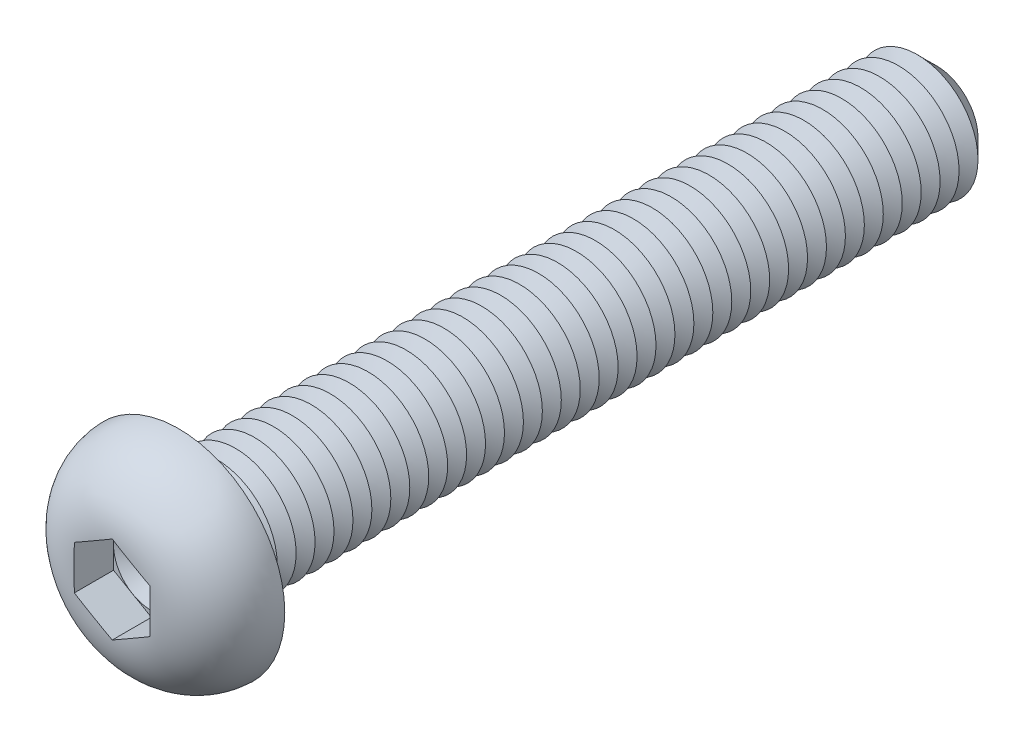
from build123d import *

# Parameters (mm, degrees)
CUT_EXTRUDE1_DEPTH  = 2.6
SKETCH4_R           = 4
BOSS_EXTRUDE1_DEPTH = 50
CHAMFER1_SIZE       = 1.25
LPATTERN1_COUNT     = 38
LPATTERN1_PITCH     = 1.25
FILLET2_R           = 0.5


with BuildPart() as part:
    # Sketch2 → Revolve1 (revolve)
    with BuildSketch(Plane(origin=(0, 0, 0), x_dir=(0, 0, -1), z_dir=(1, 0, 0)), mode=Mode.PRIVATE) as revolve1_sk:
        with BuildLine():
            Line((0, 0), (-4.4, 0))
            Line((-4.4, 0), (-4.4, 2.501111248))
            ThreePointArc((-4.4, 2.501111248), (-3.117141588, 5.647537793), (0, 7))
            Line((0, 7), (0, 0))
        make_face()
    revolve(revolve1_sk.sketch.rotate(Axis((0, 0, 47.934239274), (0, 0, -1)), 90), axis=Axis((0, 0, 47.934239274), (0, 0, -1)))

    # Sketch3 → Cut-Extrude1 (cut)
    with BuildSketch(Plane.XY.offset(4.4)):
        Polygon((0, 2.886751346), (-2.5, 1.443375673), (-2.5, -1.443375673), (0, -2.886751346), (2.5, -1.443375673), (2.5, 1.443375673), align=None)
    extrude(amount=-CUT_EXTRUDE1_DEPTH, mode=Mode.SUBTRACT)

    # Sketch4 → Boss-Extrude1 (add)
    with BuildSketch(Plane(origin=(0, 0, 0), x_dir=(-1, 0, 0), z_dir=(0, 0, -1))):
        with Locations(Location((0, 0, 0), (0, 0, 180))):
            Circle(SKETCH4_R)
    extrude(amount=BOSS_EXTRUDE1_DEPTH)

    # Chamfer1
    chamfer1_edges = [part.edges().sort_by_distance(p)[0] for p in [
        (-4, 0, -50),
    ]]
    chamfer(chamfer1_edges, length=CHAMFER1_SIZE)

    # Sketch5 → Cut-Revolve1 (revolve, cut)
    with BuildSketch(Plane(origin=(0, 0, 0), x_dir=(0, 0, -1), z_dir=(1, 0, 0)), mode=Mode.PRIVATE) as cut_revolve1_sk:
        Polygon((1.25, 4), (2.5, 4), (1.875, 2.917468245), align=None)
    cut_revolve1 = revolve(cut_revolve1_sk.sketch.rotate(Axis((0, 0, 47.934239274), (0, 0, -1)), 90), axis=Axis((0, 0, 47.934239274), (0, 0, -1)), mode=Mode.SUBTRACT)

    # LPattern1: Cut-Revolve1 ×38
    with Locations(*[(0, 0, -i * LPATTERN1_PITCH) for i in range(1, LPATTERN1_COUNT)]):
        add(cut_revolve1, mode=Mode.SUBTRACT)

    # Fillet2
    fillet2_edges = [part.edges().sort_by_distance(p)[0] for p in [
        (-4, 0, 0),
    ]]
    fillet(fillet2_edges, radius=FILLET2_R)

    # Cut-Extrude2 cone 1 section (on through the dimple's axis) → Cut-Extrude2 (revolve, cut)
    with BuildSketch(Plane(origin=(0, 0, 1.8), x_dir=(0, -1, 0), z_dir=(1, 0, 0))):
        Polygon((0, 0), (2.5, 0), (0, 1.443375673), align=None)
    revolve(axis=Axis((0, 0, 1.8), (0, 0, -1)), mode=Mode.SUBTRACT)


solid = part.part
